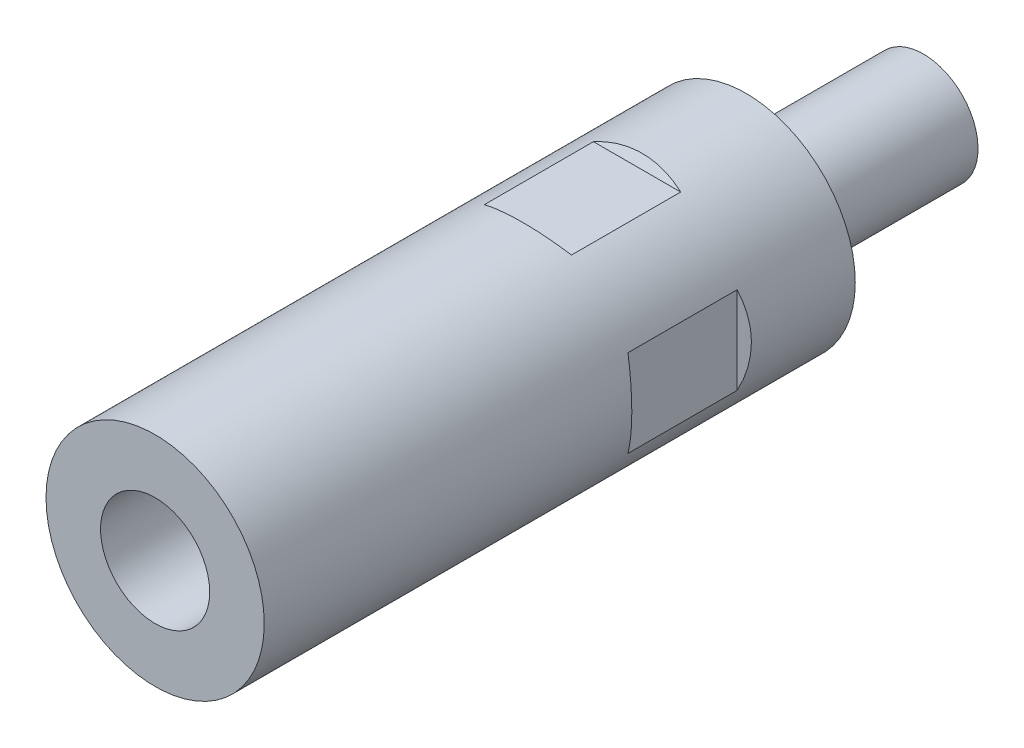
ISO-10303-21;
HEADER;
FILE_DESCRIPTION(('STEP AP214'),'2;1');
FILE_NAME('part.step','',(''),(''),'','','');
FILE_SCHEMA(('AUTOMOTIVE_DESIGN { 1 0 10303 214 1 1 1 1 }'));
ENDSEC;
DATA;
#1=APPLICATION_CONTEXT('core data for automotive mechanical design processes');
#2=APPLICATION_PROTOCOL_DEFINITION('international standard','automotive_design',2000,#1);
#3=PRODUCT_CONTEXT('',#1,'mechanical');
#4=PRODUCT('Part','Part','',(#3));
#5=PRODUCT_RELATED_PRODUCT_CATEGORY('part','',(#4));
#6=PRODUCT_DEFINITION_FORMATION('','',#4);
#7=PRODUCT_DEFINITION_CONTEXT('part definition',#1,'design');
#8=PRODUCT_DEFINITION('design','',#6,#7);
#9=PRODUCT_DEFINITION_SHAPE('','',#8);
#10=(LENGTH_UNIT() NAMED_UNIT(*) SI_UNIT(.MILLI.,.METRE.));
#11=(NAMED_UNIT(*) PLANE_ANGLE_UNIT() SI_UNIT($,.RADIAN.));
#12=(NAMED_UNIT(*) SI_UNIT($,.STERADIAN.) SOLID_ANGLE_UNIT());
#13=UNCERTAINTY_MEASURE_WITH_UNIT(LENGTH_MEASURE(1.E-05),#10,'distance_accuracy_value','');
#14=(GEOMETRIC_REPRESENTATION_CONTEXT(3) GLOBAL_UNCERTAINTY_ASSIGNED_CONTEXT((#13)) GLOBAL_UNIT_ASSIGNED_CONTEXT((#10,
#11,#12)) REPRESENTATION_CONTEXT('',''));
#15=CARTESIAN_POINT('',(0.,0.,0.));
#16=DIRECTION('',(0.,0.,1.));
#17=DIRECTION('',(1.,0.,0.));
#18=AXIS2_PLACEMENT_3D('',#15,#16,#17);
#19=CARTESIAN_POINT('',(0.,0.,-19.5));
#20=DIRECTION('',(0.,0.,1.));
#21=DIRECTION('',(0.,-1.,0.));
#22=AXIS2_PLACEMENT_3D('',#19,#20,#21);
#23=PLANE('',#22);
#24=CARTESIAN_POINT('',(0.,0.,-19.5));
#25=DIRECTION('',(0.,0.,1.));
#26=DIRECTION('',(0.,-1.,0.));
#27=AXIS2_PLACEMENT_3D('',#24,#25,#26);
#28=CIRCLE('',#27,6.);
#29=CARTESIAN_POINT('',(0.,-6.,-19.5));
#30=VERTEX_POINT('',#29);
#31=EDGE_CURVE('E21',#30,#30,#28,.F.);
#32=ORIENTED_EDGE('',*,*,#31,.T.);
#33=EDGE_LOOP('',(#32));
#34=FACE_BOUND('',#33,.T.);
#35=ADVANCED_FACE('F14',(#34),#23,.F.);
#36=CARTESIAN_POINT('',(0.,0.,0.5));
#37=DIRECTION('',(0.,0.,1.));
#38=DIRECTION('',(0.,-1.,0.));
#39=AXIS2_PLACEMENT_3D('',#36,#37,#38);
#40=CYLINDRICAL_SURFACE('',#39,6.);
#41=ORIENTED_EDGE('',*,*,#31,.F.);
#42=EDGE_LOOP('',(#41));
#43=FACE_BOUND('',#42,.T.);
#44=CARTESIAN_POINT('',(0.,0.,0.));
#45=DIRECTION('',(0.,0.,1.));
#46=DIRECTION('',(1.,0.,0.));
#47=AXIS2_PLACEMENT_3D('',#44,#45,#46);
#48=CIRCLE('',#47,6.);
#49=CARTESIAN_POINT('',(6.,0.,0.));
#50=VERTEX_POINT('',#49);
#51=EDGE_CURVE('E9',#50,#50,#48,.T.);
#52=ORIENTED_EDGE('',*,*,#51,.F.);
#53=EDGE_LOOP('',(#52));
#54=FACE_BOUND('',#53,.T.);
#55=ADVANCED_FACE('F108',(#43,#54),#40,.T.);
#56=CARTESIAN_POINT('',(0.,0.,65.));
#57=DIRECTION('',(0.,0.,1.));
#58=DIRECTION('',(1.,0.,0.));
#59=AXIS2_PLACEMENT_3D('',#56,#57,#58);
#60=PLANE('',#59);
#61=CARTESIAN_POINT('',(0.,0.,65.));
#62=DIRECTION('',(0.,0.,1.));
#63=DIRECTION('',(1.,0.,0.));
#64=AXIS2_PLACEMENT_3D('',#61,#62,#63);
#65=CIRCLE('',#64,6.);
#66=CARTESIAN_POINT('',(6.,0.,65.));
#67=VERTEX_POINT('',#66);
#68=EDGE_CURVE('E95',#67,#67,#65,.T.);
#69=ORIENTED_EDGE('',*,*,#68,.F.);
#70=EDGE_LOOP('',(#69));
#71=FACE_BOUND('',#70,.T.);
#72=CARTESIAN_POINT('',(0.,0.,65.));
#73=DIRECTION('',(0.,0.,1.));
#74=DIRECTION('',(1.,0.,0.));
#75=AXIS2_PLACEMENT_3D('',#72,#73,#74);
#76=CIRCLE('',#75,12.);
#77=CARTESIAN_POINT('',(12.,0.,65.));
#78=VERTEX_POINT('',#77);
#79=EDGE_CURVE('E143',#78,#78,#76,.T.);
#80=ORIENTED_EDGE('',*,*,#79,.T.);
#81=EDGE_LOOP('',(#80));
#82=FACE_BOUND('',#81,.T.);
#83=ADVANCED_FACE('F111',(#71,#82),#60,.T.);
#84=CARTESIAN_POINT('',(11.,-12.,24.));
#85=DIRECTION('',(-0.5,0.,0.866025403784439));
#86=DIRECTION('',(0.866025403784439,0.,0.5));
#87=AXIS2_PLACEMENT_3D('',#84,#85,#86);
#88=PLANE('',#87);
#89=DIRECTION('',(0.,1.,0.));
#90=VECTOR('',#89,1.);
#91=CARTESIAN_POINT('',(11.,-12.,24.));
#92=LINE('',#91,#90);
#93=CARTESIAN_POINT('',(11.,-4.79583152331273,24.));
#94=VERTEX_POINT('',#93);
#95=CARTESIAN_POINT('',(11.,4.79583152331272,24.));
#96=VERTEX_POINT('',#95);
#97=EDGE_CURVE('E150',#94,#96,#92,.T.);
#98=ORIENTED_EDGE('',*,*,#97,.T.);
#99=CARTESIAN_POINT('',(0.,0.,17.6491470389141));
#100=DIRECTION('',(-0.5,0.,0.866025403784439));
#101=DIRECTION('',(-0.866025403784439,0.,-0.5));
#102=AXIS2_PLACEMENT_3D('',#99,#100,#101);
#103=ELLIPSE('',#102,13.856406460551,12.);
#104=EDGE_CURVE('E34',#94,#96,#103,.T.);
#105=ORIENTED_EDGE('',*,*,#104,.F.);
#106=EDGE_LOOP('',(#98,#105));
#107=FACE_BOUND('',#106,.T.);
#108=ADVANCED_FACE('F132',(#107),#88,.F.);
#109=CARTESIAN_POINT('',(11.,-12.,24.));
#110=DIRECTION('',(-1.,0.,0.));
#111=DIRECTION('',(0.,0.,1.));
#112=AXIS2_PLACEMENT_3D('',#109,#110,#111);
#113=PLANE('',#112);
#114=ORIENTED_EDGE('',*,*,#97,.F.);
#115=DIRECTION('',(0.,0.,-1.));
#116=VECTOR('',#115,1.);
#117=CARTESIAN_POINT('',(11.,-4.79583152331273,65.));
#118=LINE('',#117,#116);
#119=CARTESIAN_POINT('',(11.,-4.79583152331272,12.));
#120=VERTEX_POINT('',#119);
#121=EDGE_CURVE('E156',#120,#94,#118,.F.);
#122=ORIENTED_EDGE('',*,*,#121,.F.);
#123=DIRECTION('',(0.,1.,0.));
#124=VECTOR('',#123,1.);
#125=CARTESIAN_POINT('',(11.,-12.,12.));
#126=LINE('',#125,#124);
#127=CARTESIAN_POINT('',(11.,4.79583152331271,12.));
#128=VERTEX_POINT('',#127);
#129=EDGE_CURVE('E199',#120,#128,#126,.T.);
#130=ORIENTED_EDGE('',*,*,#129,.T.);
#131=DIRECTION('',(0.,0.,-1.));
#132=VECTOR('',#131,1.);
#133=CARTESIAN_POINT('',(11.,4.79583152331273,65.));
#134=LINE('',#133,#132);
#135=EDGE_CURVE('E28',#96,#128,#134,.T.);
#136=ORIENTED_EDGE('',*,*,#135,.F.);
#137=EDGE_LOOP('',(#114,#122,#130,#136));
#138=FACE_BOUND('',#137,.T.);
#139=ADVANCED_FACE('F137',(#138),#113,.F.);
#140=CARTESIAN_POINT('',(11.,-12.,12.));
#141=DIRECTION('',(-0.5,0.,-0.866025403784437));
#142=DIRECTION('',(-0.866025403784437,0.,0.5));
#143=AXIS2_PLACEMENT_3D('',#140,#141,#142);
#144=PLANE('',#143);
#145=CARTESIAN_POINT('',(0.,0.,18.350852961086));
#146=DIRECTION('',(-0.5,0.,-0.866025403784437));
#147=DIRECTION('',(0.866025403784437,0.,-0.5));
#148=AXIS2_PLACEMENT_3D('',#145,#146,#147);
#149=ELLIPSE('',#148,13.856406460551,12.);
#150=EDGE_CURVE('E145',#128,#120,#149,.T.);
#151=ORIENTED_EDGE('',*,*,#150,.F.);
#152=ORIENTED_EDGE('',*,*,#129,.F.);
#153=EDGE_LOOP('',(#151,#152));
#154=FACE_BOUND('',#153,.T.);
#155=ADVANCED_FACE('F206',(#154),#144,.F.);
#156=CARTESIAN_POINT('',(-11.,-12.,12.));
#157=DIRECTION('',(0.5,0.,-0.866025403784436));
#158=DIRECTION('',(-0.866025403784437,0.,-0.5));
#159=AXIS2_PLACEMENT_3D('',#156,#157,#158);
#160=PLANE('',#159);
#161=CARTESIAN_POINT('',(0.,0.,18.350852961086));
#162=DIRECTION('',(0.5,0.,-0.866025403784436));
#163=DIRECTION('',(-0.866025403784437,0.,-0.5));
#164=AXIS2_PLACEMENT_3D('',#161,#162,#163);
#165=ELLIPSE('',#164,13.8564064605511,12.);
#166=CARTESIAN_POINT('',(-11.,-4.79583152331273,12.));
#167=VERTEX_POINT('',#166);
#168=CARTESIAN_POINT('',(-11.,4.79583152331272,12.));
#169=VERTEX_POINT('',#168);
#170=EDGE_CURVE('E159',#167,#169,#165,.T.);
#171=ORIENTED_EDGE('',*,*,#170,.F.);
#172=DIRECTION('',(0.,1.,0.));
#173=VECTOR('',#172,1.);
#174=CARTESIAN_POINT('',(-11.,-12.,12.));
#175=LINE('',#174,#173);
#176=EDGE_CURVE('E192',#167,#169,#175,.T.);
#177=ORIENTED_EDGE('',*,*,#176,.T.);
#178=EDGE_LOOP('',(#171,#177));
#179=FACE_BOUND('',#178,.T.);
#180=ADVANCED_FACE('F208',(#179),#160,.F.);
#181=CARTESIAN_POINT('',(-11.,-12.,24.));
#182=DIRECTION('',(0.5,0.,0.866025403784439));
#183=DIRECTION('',(0.866025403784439,0.,-0.5));
#184=AXIS2_PLACEMENT_3D('',#181,#182,#183);
#185=PLANE('',#184);
#186=DIRECTION('',(0.,1.,0.));
#187=VECTOR('',#186,1.);
#188=CARTESIAN_POINT('',(-11.,-12.,24.));
#189=LINE('',#188,#187);
#190=CARTESIAN_POINT('',(-11.,-4.79583152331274,24.));
#191=VERTEX_POINT('',#190);
#192=CARTESIAN_POINT('',(-11.,4.79583152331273,24.));
#193=VERTEX_POINT('',#192);
#194=EDGE_CURVE('E196',#191,#193,#189,.T.);
#195=ORIENTED_EDGE('',*,*,#194,.F.);
#196=CARTESIAN_POINT('',(0.,0.,17.6491470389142));
#197=DIRECTION('',(0.5,0.,0.866025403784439));
#198=DIRECTION('',(0.866025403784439,0.,-0.5));
#199=AXIS2_PLACEMENT_3D('',#196,#197,#198);
#200=ELLIPSE('',#199,13.856406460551,12.);
#201=EDGE_CURVE('E167',#193,#191,#200,.T.);
#202=ORIENTED_EDGE('',*,*,#201,.F.);
#203=EDGE_LOOP('',(#195,#202));
#204=FACE_BOUND('',#203,.T.);
#205=ADVANCED_FACE('F214',(#204),#185,.F.);
#206=CARTESIAN_POINT('',(-11.,-12.,24.));
#207=DIRECTION('',(1.,0.,0.));
#208=DIRECTION('',(0.,0.,-1.));
#209=AXIS2_PLACEMENT_3D('',#206,#207,#208);
#210=PLANE('',#209);
#211=ORIENTED_EDGE('',*,*,#194,.T.);
#212=DIRECTION('',(0.,0.,-1.));
#213=VECTOR('',#212,1.);
#214=CARTESIAN_POINT('',(-11.,4.79583152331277,65.));
#215=LINE('',#214,#213);
#216=EDGE_CURVE('E161',#169,#193,#215,.F.);
#217=ORIENTED_EDGE('',*,*,#216,.F.);
#218=ORIENTED_EDGE('',*,*,#176,.F.);
#219=DIRECTION('',(0.,0.,-1.));
#220=VECTOR('',#219,1.);
#221=CARTESIAN_POINT('',(-11.,-4.79583152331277,65.));
#222=LINE('',#221,#220);
#223=EDGE_CURVE('E164',#191,#167,#222,.T.);
#224=ORIENTED_EDGE('',*,*,#223,.F.);
#225=EDGE_LOOP('',(#211,#217,#218,#224));
#226=FACE_BOUND('',#225,.T.);
#227=ADVANCED_FACE('F219',(#226),#210,.F.);
#228=CARTESIAN_POINT('',(12.,11.,24.));
#229=DIRECTION('',(0.,-0.5,0.866025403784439));
#230=DIRECTION('',(0.,-0.866025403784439,-0.5));
#231=AXIS2_PLACEMENT_3D('',#228,#229,#230);
#232=PLANE('',#231);
#233=DIRECTION('',(-1.,0.,0.));
#234=VECTOR('',#233,1.);
#235=CARTESIAN_POINT('',(12.,11.,24.));
#236=LINE('',#235,#234);
#237=CARTESIAN_POINT('',(4.79583152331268,11.,24.));
#238=VERTEX_POINT('',#237);
#239=CARTESIAN_POINT('',(-4.79583152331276,11.,24.));
#240=VERTEX_POINT('',#239);
#241=EDGE_CURVE('E188',#238,#240,#236,.T.);
#242=ORIENTED_EDGE('',*,*,#241,.T.);
#243=CARTESIAN_POINT('',(0.,0.,17.6491470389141));
#244=DIRECTION('',(0.,-0.5,0.866025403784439));
#245=DIRECTION('',(0.,-0.866025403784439,-0.5));
#246=AXIS2_PLACEMENT_3D('',#243,#244,#245);
#247=ELLIPSE('',#246,13.856406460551,12.);
#248=EDGE_CURVE('E175',#238,#240,#247,.T.);
#249=ORIENTED_EDGE('',*,*,#248,.F.);
#250=EDGE_LOOP('',(#242,#249));
#251=FACE_BOUND('',#250,.T.);
#252=ADVANCED_FACE('F221',(#251),#232,.F.);
#253=CARTESIAN_POINT('',(12.,11.,24.));
#254=DIRECTION('',(0.,-1.,0.));
#255=DIRECTION('',(1.,0.,0.));
#256=AXIS2_PLACEMENT_3D('',#253,#254,#255);
#257=PLANE('',#256);
#258=ORIENTED_EDGE('',*,*,#241,.F.);
#259=DIRECTION('',(0.,0.,-1.));
#260=VECTOR('',#259,1.);
#261=CARTESIAN_POINT('',(4.79583152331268,11.,65.));
#262=LINE('',#261,#260);
#263=CARTESIAN_POINT('',(4.79583152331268,11.,12.));
#264=VERTEX_POINT('',#263);
#265=EDGE_CURVE('E87',#264,#238,#262,.F.);
#266=ORIENTED_EDGE('',*,*,#265,.F.);
#267=DIRECTION('',(-1.,0.,0.));
#268=VECTOR('',#267,1.);
#269=CARTESIAN_POINT('',(12.,11.,12.));
#270=LINE('',#269,#268);
#271=CARTESIAN_POINT('',(-4.79583152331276,11.,12.));
#272=VERTEX_POINT('',#271);
#273=EDGE_CURVE('E186',#264,#272,#270,.T.);
#274=ORIENTED_EDGE('',*,*,#273,.T.);
#275=DIRECTION('',(0.,0.,-1.));
#276=VECTOR('',#275,1.);
#277=CARTESIAN_POINT('',(-4.79583152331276,11.,65.));
#278=LINE('',#277,#276);
#279=EDGE_CURVE('E172',#240,#272,#278,.T.);
#280=ORIENTED_EDGE('',*,*,#279,.F.);
#281=EDGE_LOOP('',(#258,#266,#274,#280));
#282=FACE_BOUND('',#281,.T.);
#283=ADVANCED_FACE('F185',(#282),#257,.F.);
#284=CARTESIAN_POINT('',(12.,11.,12.));
#285=DIRECTION('',(0.,-0.5,-0.866025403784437));
#286=DIRECTION('',(0.,0.866025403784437,-0.5));
#287=AXIS2_PLACEMENT_3D('',#284,#285,#286);
#288=PLANE('',#287);
#289=CARTESIAN_POINT('',(0.,0.,18.350852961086));
#290=DIRECTION('',(0.,-0.5,-0.866025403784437));
#291=DIRECTION('',(0.,0.866025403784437,-0.5));
#292=AXIS2_PLACEMENT_3D('',#289,#290,#291);
#293=ELLIPSE('',#292,13.856406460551,12.);
#294=EDGE_CURVE('E170',#272,#264,#293,.T.);
#295=ORIENTED_EDGE('',*,*,#294,.F.);
#296=ORIENTED_EDGE('',*,*,#273,.F.);
#297=EDGE_LOOP('',(#295,#296));
#298=FACE_BOUND('',#297,.T.);
#299=ADVANCED_FACE('F190',(#298),#288,.F.);
#300=CARTESIAN_POINT('',(12.,-11.,12.));
#301=DIRECTION('',(0.,0.5,-0.866025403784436));
#302=DIRECTION('',(0.,0.866025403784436,0.5));
#303=AXIS2_PLACEMENT_3D('',#300,#301,#302);
#304=PLANE('',#303);
#305=CARTESIAN_POINT('',(0.,0.,18.350852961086));
#306=DIRECTION('',(0.,0.5,-0.866025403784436));
#307=DIRECTION('',(0.,-0.866025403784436,-0.5));
#308=AXIS2_PLACEMENT_3D('',#305,#306,#307);
#309=ELLIPSE('',#308,13.8564064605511,12.);
#310=CARTESIAN_POINT('',(4.79583152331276,-11.,12.));
#311=VERTEX_POINT('',#310);
#312=CARTESIAN_POINT('',(-4.79583152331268,-11.,12.));
#313=VERTEX_POINT('',#312);
#314=EDGE_CURVE('E78',#311,#313,#309,.T.);
#315=ORIENTED_EDGE('',*,*,#314,.F.);
#316=DIRECTION('',(-1.,0.,0.));
#317=VECTOR('',#316,1.);
#318=CARTESIAN_POINT('',(12.,-11.,12.));
#319=LINE('',#318,#317);
#320=EDGE_CURVE('E81',#311,#313,#319,.T.);
#321=ORIENTED_EDGE('',*,*,#320,.T.);
#322=EDGE_LOOP('',(#315,#321));
#323=FACE_BOUND('',#322,.T.);
#324=ADVANCED_FACE('F80',(#323),#304,.F.);
#325=CARTESIAN_POINT('',(12.,-11.,24.));
#326=DIRECTION('',(0.,0.5,0.866025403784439));
#327=DIRECTION('',(0.,-0.866025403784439,0.5));
#328=AXIS2_PLACEMENT_3D('',#325,#326,#327);
#329=PLANE('',#328);
#330=DIRECTION('',(-1.,0.,0.));
#331=VECTOR('',#330,1.);
#332=CARTESIAN_POINT('',(12.,-11.,24.));
#333=LINE('',#332,#331);
#334=CARTESIAN_POINT('',(4.79583152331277,-11.,24.));
#335=VERTEX_POINT('',#334);
#336=CARTESIAN_POINT('',(-4.79583152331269,-11.,24.));
#337=VERTEX_POINT('',#336);
#338=EDGE_CURVE('E94',#335,#337,#333,.T.);
#339=ORIENTED_EDGE('',*,*,#338,.F.);
#340=CARTESIAN_POINT('',(0.,0.,17.6491470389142));
#341=DIRECTION('',(0.,0.5,0.866025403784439));
#342=DIRECTION('',(0.,0.866025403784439,-0.5));
#343=AXIS2_PLACEMENT_3D('',#340,#341,#342);
#344=ELLIPSE('',#343,13.856406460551,12.);
#345=EDGE_CURVE('E100',#337,#335,#344,.T.);
#346=ORIENTED_EDGE('',*,*,#345,.F.);
#347=EDGE_LOOP('',(#339,#346));
#348=FACE_BOUND('',#347,.T.);
#349=ADVANCED_FACE('F236',(#348),#329,.F.);
#350=CARTESIAN_POINT('',(12.,-11.,24.));
#351=DIRECTION('',(0.,1.,0.));
#352=DIRECTION('',(-1.,0.,0.));
#353=AXIS2_PLACEMENT_3D('',#350,#351,#352);
#354=PLANE('',#353);
#355=ORIENTED_EDGE('',*,*,#338,.T.);
#356=DIRECTION('',(0.,0.,-1.));
#357=VECTOR('',#356,1.);
#358=CARTESIAN_POINT('',(-4.79583152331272,-11.,65.));
#359=LINE('',#358,#357);
#360=EDGE_CURVE('E86',#313,#337,#359,.F.);
#361=ORIENTED_EDGE('',*,*,#360,.F.);
#362=ORIENTED_EDGE('',*,*,#320,.F.);
#363=DIRECTION('',(0.,0.,-1.));
#364=VECTOR('',#363,1.);
#365=CARTESIAN_POINT('',(4.7958315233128,-11.,65.));
#366=LINE('',#365,#364);
#367=EDGE_CURVE('E92',#335,#311,#366,.T.);
#368=ORIENTED_EDGE('',*,*,#367,.F.);
#369=EDGE_LOOP('',(#355,#361,#362,#368));
#370=FACE_BOUND('',#369,.T.);
#371=ADVANCED_FACE('F91',(#370),#354,.F.);
#372=CARTESIAN_POINT('',(0.,0.,65.));
#373=DIRECTION('',(0.,0.,-1.));
#374=DIRECTION('',(-1.,0.,0.));
#375=AXIS2_PLACEMENT_3D('',#372,#373,#374);
#376=CYLINDRICAL_SURFACE('',#375,12.);
#377=ORIENTED_EDGE('',*,*,#360,.T.);
#378=ORIENTED_EDGE('',*,*,#345,.T.);
#379=ORIENTED_EDGE('',*,*,#367,.T.);
#380=ORIENTED_EDGE('',*,*,#314,.T.);
#381=EDGE_LOOP('',(#377,#378,#379,#380));
#382=FACE_BOUND('',#381,.T.);
#383=ORIENTED_EDGE('',*,*,#294,.T.);
#384=ORIENTED_EDGE('',*,*,#265,.T.);
#385=ORIENTED_EDGE('',*,*,#248,.T.);
#386=ORIENTED_EDGE('',*,*,#279,.T.);
#387=EDGE_LOOP('',(#383,#384,#385,#386));
#388=FACE_BOUND('',#387,.T.);
#389=ORIENTED_EDGE('',*,*,#216,.T.);
#390=ORIENTED_EDGE('',*,*,#201,.T.);
#391=ORIENTED_EDGE('',*,*,#223,.T.);
#392=ORIENTED_EDGE('',*,*,#170,.T.);
#393=EDGE_LOOP('',(#389,#390,#391,#392));
#394=FACE_BOUND('',#393,.T.);
#395=ORIENTED_EDGE('',*,*,#150,.T.);
#396=ORIENTED_EDGE('',*,*,#121,.T.);
#397=ORIENTED_EDGE('',*,*,#104,.T.);
#398=ORIENTED_EDGE('',*,*,#135,.T.);
#399=EDGE_LOOP('',(#395,#396,#397,#398));
#400=FACE_BOUND('',#399,.T.);
#401=ORIENTED_EDGE('',*,*,#79,.F.);
#402=EDGE_LOOP('',(#401));
#403=FACE_BOUND('',#402,.T.);
#404=CARTESIAN_POINT('',(0.,0.,0.));
#405=DIRECTION('',(0.,0.,1.));
#406=DIRECTION('',(1.,0.,0.));
#407=AXIS2_PLACEMENT_3D('',#404,#405,#406);
#408=CIRCLE('',#407,12.);
#409=CARTESIAN_POINT('',(12.,0.,0.));
#410=VERTEX_POINT('',#409);
#411=EDGE_CURVE('E146',#410,#410,#408,.T.);
#412=ORIENTED_EDGE('',*,*,#411,.T.);
#413=EDGE_LOOP('',(#412));
#414=FACE_BOUND('',#413,.T.);
#415=ADVANCED_FACE('F98',(#382,#388,#394,#400,#403,#414),#376,.T.);
#416=CARTESIAN_POINT('',(0.,0.,0.));
#417=DIRECTION('',(0.,0.,1.));
#418=DIRECTION('',(1.,0.,0.));
#419=AXIS2_PLACEMENT_3D('',#416,#417,#418);
#420=PLANE('',#419);
#421=ORIENTED_EDGE('',*,*,#411,.F.);
#422=EDGE_LOOP('',(#421));
#423=FACE_BOUND('',#422,.T.);
#424=ORIENTED_EDGE('',*,*,#51,.T.);
#425=EDGE_LOOP('',(#424));
#426=FACE_BOUND('',#425,.T.);
#427=ADVANCED_FACE('F114',(#423,#426),#420,.F.);
#428=CARTESIAN_POINT('',(0.,0.,65.));
#429=DIRECTION('',(0.,0.,1.));
#430=DIRECTION('',(1.,0.,0.));
#431=AXIS2_PLACEMENT_3D('',#428,#429,#430);
#432=CYLINDRICAL_SURFACE('',#431,6.);
#433=CARTESIAN_POINT('',(0.,0.,35.));
#434=DIRECTION('',(0.,0.,1.));
#435=DIRECTION('',(1.,0.,0.));
#436=AXIS2_PLACEMENT_3D('',#433,#434,#435);
#437=CIRCLE('',#436,6.);
#438=CARTESIAN_POINT('',(6.,0.,35.));
#439=VERTEX_POINT('',#438);
#440=EDGE_CURVE('E362',#439,#439,#437,.T.);
#441=ORIENTED_EDGE('',*,*,#440,.F.);
#442=EDGE_LOOP('',(#441));
#443=FACE_BOUND('',#442,.T.);
#444=ORIENTED_EDGE('',*,*,#68,.T.);
#445=EDGE_LOOP('',(#444));
#446=FACE_BOUND('',#445,.T.);
#447=ADVANCED_FACE('F116',(#443,#446),#432,.F.);
#448=CARTESIAN_POINT('',(6.,0.,35.));
#449=DIRECTION('',(0.,0.,-1.));
#450=DIRECTION('',(-1.,0.,0.));
#451=AXIS2_PLACEMENT_3D('',#448,#449,#450);
#452=PLANE('',#451);
#453=ORIENTED_EDGE('',*,*,#440,.T.);
#454=EDGE_LOOP('',(#453));
#455=FACE_BOUND('',#454,.T.);
#456=ADVANCED_FACE('F124',(#455),#452,.F.);
#457=CLOSED_SHELL('',(#35,#55,#83,#108,#139,#155,#180,#205,#227,#252,#283,#299,#324,#349,#371,
#415,#427,#447,#456));
#458=MANIFOLD_SOLID_BREP('B1',#457);
#459=ADVANCED_BREP_SHAPE_REPRESENTATION('',(#18,#458),#14);
#460=SHAPE_DEFINITION_REPRESENTATION(#9,#459);
ENDSEC;
END-ISO-10303-21;
